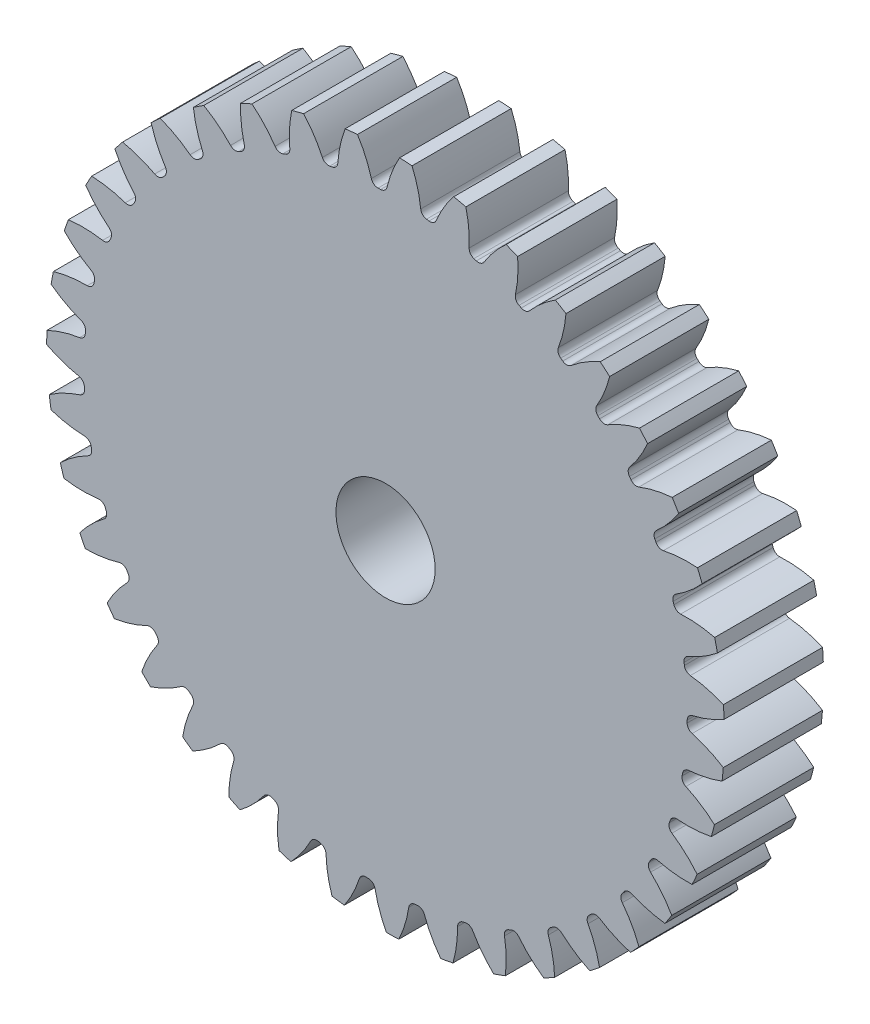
from build123d import *

# Parameters (mm, degrees)
SKETCH3_R         = 347.133333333
GEARBODY_DEPTH    = 101.6
TOOTHCUT_DEPTH    = 502.323909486
CIRPATTERN1_COUNT = 39
BOREDIA_R         = 50.8
BORE_DEPTH        = 12700


with BuildPart() as part:
    # Sketch3 → gearBody (new body)
    with BuildSketch(Plane.XY):
        Circle(SKETCH3_R)
    extrude(amount=GEARBODY_DEPTH)

    # Sketch2 → toothCut (cut, through all)
    with BuildSketch(Plane.XY):
        with BuildLine():
            ThreePointArc((308.945950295, -7.348530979), (308.974459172, -6.031972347), (308.997357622, -4.715304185))
            ThreePointArc((308.997357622, -4.715304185), (310.516156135, -0.503450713), (314.30231957, 1.886408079))
            ThreePointArc((314.30231957, 1.886408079), (331.20300259, 7.227466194), (347.133333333, 14.998215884))
            ThreePointArc((347.133333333, 14.998215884), (347.390993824, -6.781961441), (346.283444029, -28.535486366))
            ThreePointArc((346.283444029, -28.535486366), (330.66854598, -20.148893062), (313.989203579, -14.152266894))
            ThreePointArc((313.989203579, -14.152266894), (310.29920186, -11.616454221), (308.945950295, -7.348530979))
        make_face()
    toothcut = extrude(amount=TOOTHCUT_DEPTH, mode=Mode.SUBTRACT)

    # CirPattern1: toothCut ×39 about axis
    cirpattern1_axis = Axis((0, 0, 0), (0, 0, 1))
    for i in range(1, CIRPATTERN1_COUNT):
        add(toothcut.rotate(cirpattern1_axis, i * 360 / CIRPATTERN1_COUNT), mode=Mode.SUBTRACT)

    # boreDia → bore (cut, symmetric)
    with BuildSketch(Plane.XY):
        Circle(BOREDIA_R)
    extrude(amount=BORE_DEPTH, both=True, mode=Mode.SUBTRACT)


solid = part.part
